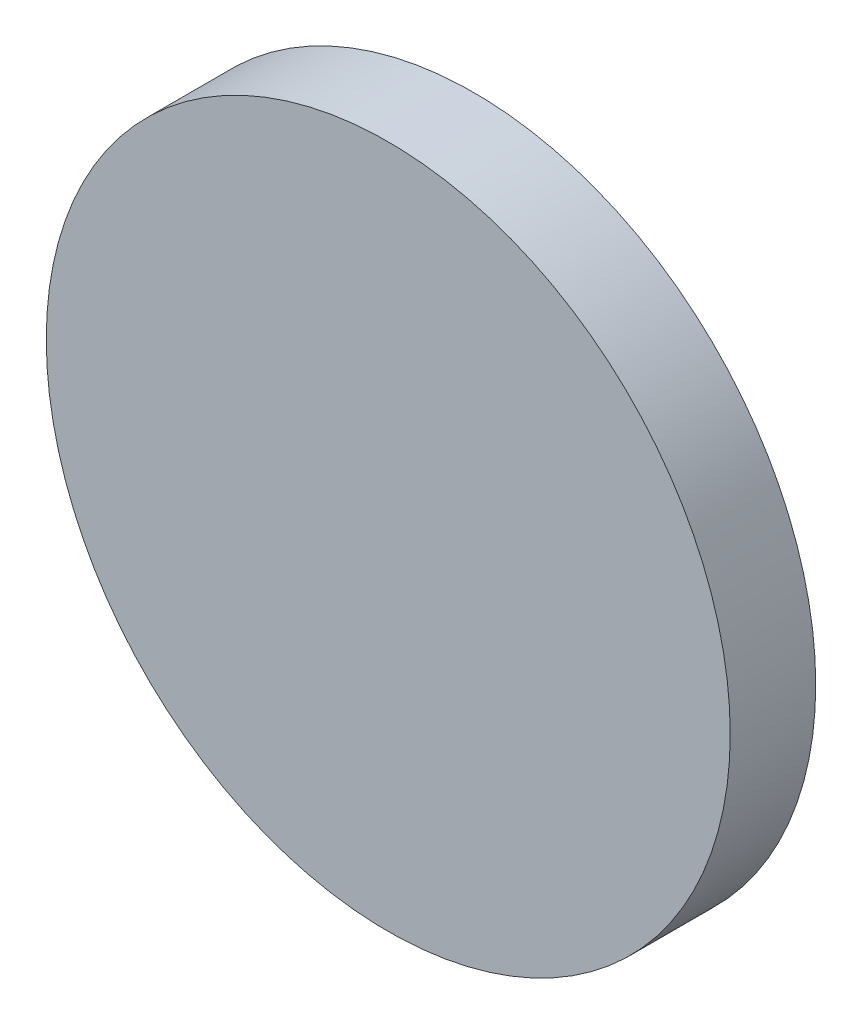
from build123d import *

# Parameters (mm, degrees)
ESQUISSE1_R          = 20
BASE_EXTRUSION_DEPTH = 5


with BuildPart() as part:
    # Esquisse1 → Base-Extrusion (new body)
    with BuildSketch(Plane.XY):
        Circle(ESQUISSE1_R)
    extrude(amount=BASE_EXTRUSION_DEPTH)


solid = part.part
